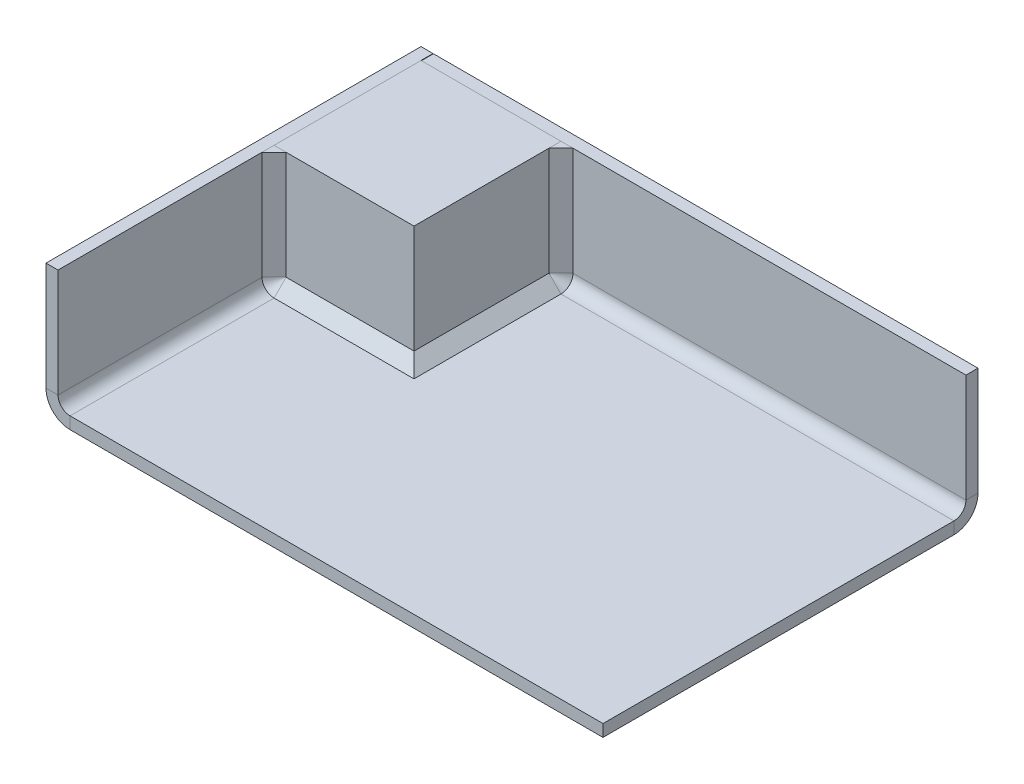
ISO-10303-21;
HEADER;
FILE_DESCRIPTION(('STEP AP214'),'2;1');
FILE_NAME('part.step','',(''),(''),'','','');
FILE_SCHEMA(('AUTOMOTIVE_DESIGN { 1 0 10303 214 1 1 1 1 }'));
ENDSEC;
DATA;
#1=APPLICATION_CONTEXT('core data for automotive mechanical design processes');
#2=APPLICATION_PROTOCOL_DEFINITION('international standard','automotive_design',2000,#1);
#3=PRODUCT_CONTEXT('',#1,'mechanical');
#4=PRODUCT('Part','Part','',(#3));
#5=PRODUCT_RELATED_PRODUCT_CATEGORY('part','',(#4));
#6=PRODUCT_DEFINITION_FORMATION('','',#4);
#7=PRODUCT_DEFINITION_CONTEXT('part definition',#1,'design');
#8=PRODUCT_DEFINITION('design','',#6,#7);
#9=PRODUCT_DEFINITION_SHAPE('','',#8);
#10=(LENGTH_UNIT() NAMED_UNIT(*) SI_UNIT(.MILLI.,.METRE.));
#11=(NAMED_UNIT(*) PLANE_ANGLE_UNIT() SI_UNIT($,.RADIAN.));
#12=(NAMED_UNIT(*) SI_UNIT($,.STERADIAN.) SOLID_ANGLE_UNIT());
#13=UNCERTAINTY_MEASURE_WITH_UNIT(LENGTH_MEASURE(1.E-05),#10,'distance_accuracy_value','');
#14=(GEOMETRIC_REPRESENTATION_CONTEXT(3) GLOBAL_UNCERTAINTY_ASSIGNED_CONTEXT((#13)) GLOBAL_UNIT_ASSIGNED_CONTEXT((#10,
#11,#12)) REPRESENTATION_CONTEXT('',''));
#15=CARTESIAN_POINT('',(0.,0.,0.));
#16=DIRECTION('',(0.,0.,1.));
#17=DIRECTION('',(1.,0.,0.));
#18=AXIS2_PLACEMENT_3D('',#15,#16,#17);
#19=CARTESIAN_POINT('',(-57.9818418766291,33.,-33.741615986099));
#20=DIRECTION('',(0.,-1.,0.));
#21=DIRECTION('',(1.,0.,0.));
#22=AXIS2_PLACEMENT_3D('',#19,#20,#21);
#23=PLANE('',#22);
#24=DIRECTION('',(-1.,0.,0.));
#25=VECTOR('',#24,1.);
#26=CARTESIAN_POINT('',(-20.0735004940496,33.0000000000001,2.91595713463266));
#27=LINE('',#26,#25);
#28=CARTESIAN_POINT('',(-51.9818418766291,33.,2.91595713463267));
#29=VERTEX_POINT('',#28);
#30=CARTESIAN_POINT('',(-54.9818418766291,33.0000000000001,2.91595713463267));
#31=VERTEX_POINT('',#30);
#32=EDGE_CURVE('E80',#29,#31,#27,.T.);
#33=ORIENTED_EDGE('',*,*,#32,.T.);
#34=DIRECTION('',(0.,0.,-1.));
#35=VECTOR('',#34,1.);
#36=CARTESIAN_POINT('',(-54.9818418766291,33.,-33.741615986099));
#37=LINE('',#36,#35);
#38=CARTESIAN_POINT('',(-54.9818418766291,33.,5.91595713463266));
#39=VERTEX_POINT('',#38);
#40=EDGE_CURVE('E177',#39,#31,#37,.T.);
#41=ORIENTED_EDGE('',*,*,#40,.F.);
#42=DIRECTION('',(0.707106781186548,0.,-0.707106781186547));
#43=VECTOR('',#42,1.);
#44=CARTESIAN_POINT('',(-36.6530553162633,33.0000000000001,-12.4128294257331));
#45=LINE('',#44,#43);
#46=EDGE_CURVE('E72',#39,#29,#45,.T.);
#47=ORIENTED_EDGE('',*,*,#46,.T.);
#48=EDGE_LOOP('',(#33,#41,#47));
#49=FACE_BOUND('',#48,.T.);
#50=ADVANCED_FACE('F63',(#49),#23,.F.);
#51=DIRECTION('',(0.707106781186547,0.,-0.707106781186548));
#52=VECTOR('',#51,1.);
#53=CARTESIAN_POINT('',(-37.5276711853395,33.0000000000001,-13.2874452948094));
#54=LINE('',#53,#52);
#55=CARTESIAN_POINT('',(-20.0735004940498,33.0000000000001,-30.7416159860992));
#56=VERTEX_POINT('',#55);
#57=CARTESIAN_POINT('',(-17.0735004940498,33.,-33.7416159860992));
#58=VERTEX_POINT('',#57);
#59=EDGE_CURVE('E13',#56,#58,#54,.T.);
#60=ORIENTED_EDGE('',*,*,#59,.T.);
#61=DIRECTION('',(1.,0.,0.));
#62=VECTOR('',#61,1.);
#63=CARTESIAN_POINT('',(80.9556038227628,33.,-33.7416159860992));
#64=LINE('',#63,#62);
#65=CARTESIAN_POINT('',(-20.0735004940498,33.0000000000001,-33.7416159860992));
#66=VERTEX_POINT('',#65);
#67=EDGE_CURVE('E88',#66,#58,#64,.T.);
#68=ORIENTED_EDGE('',*,*,#67,.F.);
#69=DIRECTION('',(0.,0.,1.));
#70=VECTOR('',#69,1.);
#71=CARTESIAN_POINT('',(-20.0735004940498,33.0000000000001,2.91595713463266));
#72=LINE('',#71,#70);
#73=EDGE_CURVE('E167',#66,#56,#72,.T.);
#74=ORIENTED_EDGE('',*,*,#73,.T.);
#75=EDGE_LOOP('',(#60,#68,#74));
#76=FACE_BOUND('',#75,.T.);
#77=ADVANCED_FACE('F239',(#76),#23,.F.);
#78=CARTESIAN_POINT('',(-17.0735004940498,33.,-33.7416159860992));
#79=DIRECTION('',(-0.707106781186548,0.,-0.707106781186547));
#80=DIRECTION('',(-0.707106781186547,0.,0.707106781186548));
#81=AXIS2_PLACEMENT_3D('',#78,#79,#80);
#82=PLANE('',#81);
#83=DIRECTION('',(-0.707106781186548,0.,0.707106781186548));
#84=VECTOR('',#83,1.);
#85=CARTESIAN_POINT('',(-17.0735004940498,5.99999999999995,-33.7416159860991));
#86=LINE('',#85,#84);
#87=CARTESIAN_POINT('',(-17.0735004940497,5.99999999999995,-33.7416159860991));
#88=VERTEX_POINT('',#87);
#89=CARTESIAN_POINT('',(-20.0735004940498,6.00000000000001,-30.741615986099));
#90=VERTEX_POINT('',#89);
#91=EDGE_CURVE('E67',#88,#90,#86,.T.);
#92=ORIENTED_EDGE('',*,*,#91,.F.);
#93=DIRECTION('',(0.,-1.,0.));
#94=VECTOR('',#93,1.);
#95=CARTESIAN_POINT('',(-17.0735004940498,33.,-33.7416159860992));
#96=LINE('',#95,#94);
#97=EDGE_CURVE('E201',#58,#88,#96,.T.);
#98=ORIENTED_EDGE('',*,*,#97,.F.);
#99=ORIENTED_EDGE('',*,*,#59,.F.);
#100=DIRECTION('',(0.,1.,0.));
#101=VECTOR('',#100,1.);
#102=CARTESIAN_POINT('',(-20.0735004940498,83.6198574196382,-30.7416159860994));
#103=LINE('',#102,#101);
#104=EDGE_CURVE('E205',#90,#56,#103,.T.);
#105=ORIENTED_EDGE('',*,*,#104,.F.);
#106=EDGE_LOOP('',(#92,#98,#99,#105));
#107=FACE_BOUND('',#106,.T.);
#108=ADVANCED_FACE('F65',(#107),#82,.F.);
#109=CARTESIAN_POINT('',(-17.0735004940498,6.,-30.741615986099));
#110=DIRECTION('',(1.,0.,0.));
#111=DIRECTION('',(0.,0.,-1.));
#112=AXIS2_PLACEMENT_3D('',#109,#110,#111);
#113=CONICAL_SURFACE('',#112,2.99999999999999,0.785398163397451);
#114=CARTESIAN_POINT('',(-17.0735004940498,6.,-30.741615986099));
#115=DIRECTION('',(-1.,0.,0.));
#116=DIRECTION('',(0.,0.,1.));
#117=AXIS2_PLACEMENT_3D('',#114,#115,#116);
#118=CIRCLE('',#117,3.00000002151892);
#119=CARTESIAN_POINT('',(-17.0735004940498,3.,-30.741615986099));
#120=VERTEX_POINT('',#119);
#121=EDGE_CURVE('E209',#88,#120,#118,.T.);
#122=ORIENTED_EDGE('',*,*,#121,.F.);
#123=ORIENTED_EDGE('',*,*,#91,.T.);
#124=DIRECTION('',(-0.707106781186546,0.707106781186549,0.));
#125=VECTOR('',#124,1.);
#126=CARTESIAN_POINT('',(-17.0735004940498,2.99999997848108,-30.741615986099));
#127=LINE('',#126,#125);
#128=EDGE_CURVE('E223',#120,#90,#127,.T.);
#129=ORIENTED_EDGE('',*,*,#128,.F.);
#130=EDGE_LOOP('',(#122,#123,#129));
#131=FACE_BOUND('',#130,.T.);
#132=ADVANCED_FACE('F232',(#131),#113,.F.);
#133=CARTESIAN_POINT('',(-20.0735004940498,6.00000000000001,2.91595713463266));
#134=DIRECTION('',(-0.707106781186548,-0.707106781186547,0.));
#135=DIRECTION('',(0.707106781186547,-0.707106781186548,0.));
#136=AXIS2_PLACEMENT_3D('',#133,#134,#135);
#137=PLANE('',#136);
#138=ORIENTED_EDGE('',*,*,#128,.T.);
#139=DIRECTION('',(0.,0.,-1.));
#140=VECTOR('',#139,1.);
#141=CARTESIAN_POINT('',(-20.0735004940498,6.00000000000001,2.91595713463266));
#142=LINE('',#141,#140);
#143=CARTESIAN_POINT('',(-20.0735004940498,6.00000000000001,2.91595713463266));
#144=VERTEX_POINT('',#143);
#145=EDGE_CURVE('E203',#144,#90,#142,.T.);
#146=ORIENTED_EDGE('',*,*,#145,.F.);
#147=DIRECTION('',(0.577350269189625,-0.577350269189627,0.577350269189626));
#148=VECTOR('',#147,1.);
#149=CARTESIAN_POINT('',(-20.0735004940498,6.00000000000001,2.91595713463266));
#150=LINE('',#149,#148);
#151=CARTESIAN_POINT('',(-17.0735004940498,3.00000000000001,5.91595713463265));
#152=VERTEX_POINT('',#151);
#153=EDGE_CURVE('E221',#152,#144,#150,.F.);
#154=ORIENTED_EDGE('',*,*,#153,.F.);
#155=DIRECTION('',(0.,0.,1.));
#156=VECTOR('',#155,1.);
#157=CARTESIAN_POINT('',(-17.0735004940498,3.00000000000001,56.8024326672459));
#158=LINE('',#157,#156);
#159=EDGE_CURVE('E211',#120,#152,#158,.T.);
#160=ORIENTED_EDGE('',*,*,#159,.F.);
#161=EDGE_LOOP('',(#138,#146,#154,#160));
#162=FACE_BOUND('',#161,.T.);
#163=ADVANCED_FACE('F262',(#162),#137,.F.);
#164=CARTESIAN_POINT('',(-20.0735004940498,6.00000000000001,2.91595713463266));
#165=DIRECTION('',(0.,-0.707106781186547,-0.707106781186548));
#166=DIRECTION('',(0.,0.707106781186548,-0.707106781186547));
#167=AXIS2_PLACEMENT_3D('',#164,#165,#166);
#168=PLANE('',#167);
#169=DIRECTION('',(0.,0.707106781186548,-0.707106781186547));
#170=VECTOR('',#169,1.);
#171=CARTESIAN_POINT('',(-51.981841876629,3.00000000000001,5.91595713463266));
#172=LINE('',#171,#170);
#173=CARTESIAN_POINT('',(-51.981841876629,3.00000000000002,5.91595713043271));
#174=VERTEX_POINT('',#173);
#175=CARTESIAN_POINT('',(-51.981841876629,5.99999999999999,2.91595713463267));
#176=VERTEX_POINT('',#175);
#177=EDGE_CURVE('E218',#174,#176,#172,.T.);
#178=ORIENTED_EDGE('',*,*,#177,.F.);
#179=DIRECTION('',(-1.,0.,0.));
#180=VECTOR('',#179,1.);
#181=CARTESIAN_POINT('',(-54.981841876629,3.00000000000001,5.91595713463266));
#182=LINE('',#181,#180);
#183=EDGE_CURVE('E213',#152,#174,#182,.T.);
#184=ORIENTED_EDGE('',*,*,#183,.F.);
#185=ORIENTED_EDGE('',*,*,#153,.T.);
#186=DIRECTION('',(1.,0.,0.));
#187=VECTOR('',#186,1.);
#188=CARTESIAN_POINT('',(-20.0735004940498,6.00000000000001,2.91595713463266));
#189=LINE('',#188,#187);
#190=EDGE_CURVE('E145',#176,#144,#189,.T.);
#191=ORIENTED_EDGE('',*,*,#190,.F.);
#192=EDGE_LOOP('',(#178,#184,#185,#191));
#193=FACE_BOUND('',#192,.T.);
#194=ADVANCED_FACE('F258',(#193),#168,.F.);
#195=CARTESIAN_POINT('',(-51.981841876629,6.,5.91595713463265));
#196=DIRECTION('',(0.,0.,1.));
#197=DIRECTION('',(1.,0.,0.));
#198=AXIS2_PLACEMENT_3D('',#195,#196,#197);
#199=CONICAL_SURFACE('',#198,2.99999999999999,0.785398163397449);
#200=CARTESIAN_POINT('',(-51.981841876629,6.,5.91595713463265));
#201=DIRECTION('',(0.,0.,-1.));
#202=DIRECTION('',(-1.,0.,0.));
#203=AXIS2_PLACEMENT_3D('',#200,#201,#202);
#204=CIRCLE('',#203,2.99999999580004);
#205=CARTESIAN_POINT('',(-54.981841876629,5.99999999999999,5.91595713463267));
#206=VERTEX_POINT('',#205);
#207=EDGE_CURVE('E207',#174,#206,#204,.T.);
#208=ORIENTED_EDGE('',*,*,#207,.F.);
#209=ORIENTED_EDGE('',*,*,#177,.T.);
#210=DIRECTION('',(0.70710678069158,0.,-0.707106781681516));
#211=VECTOR('',#210,1.);
#212=CARTESIAN_POINT('',(-54.9818418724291,5.99999999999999,5.91595713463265));
#213=LINE('',#212,#211);
#214=EDGE_CURVE('E191',#206,#176,#213,.T.);
#215=ORIENTED_EDGE('',*,*,#214,.F.);
#216=EDGE_LOOP('',(#208,#209,#215));
#217=FACE_BOUND('',#216,.T.);
#218=ADVANCED_FACE('F254',(#217),#199,.F.);
#219=CARTESIAN_POINT('',(-51.9818418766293,83.6198574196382,2.91595713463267));
#220=DIRECTION('',(-0.707106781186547,0.,-0.707106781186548));
#221=DIRECTION('',(-0.707106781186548,0.,0.707106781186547));
#222=AXIS2_PLACEMENT_3D('',#219,#220,#221);
#223=PLANE('',#222);
#224=ORIENTED_EDGE('',*,*,#46,.F.);
#225=DIRECTION('',(0.,1.,0.));
#226=VECTOR('',#225,1.);
#227=CARTESIAN_POINT('',(-54.9818418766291,33.,5.91595713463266));
#228=LINE('',#227,#226);
#229=EDGE_CURVE('E199',#206,#39,#228,.T.);
#230=ORIENTED_EDGE('',*,*,#229,.F.);
#231=ORIENTED_EDGE('',*,*,#214,.T.);
#232=DIRECTION('',(0.,-1.,0.));
#233=VECTOR('',#232,1.);
#234=CARTESIAN_POINT('',(-51.9818418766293,83.6198574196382,2.91595713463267));
#235=LINE('',#234,#233);
#236=EDGE_CURVE('E197',#29,#176,#235,.T.);
#237=ORIENTED_EDGE('',*,*,#236,.F.);
#238=EDGE_LOOP('',(#224,#230,#231,#237));
#239=FACE_BOUND('',#238,.T.);
#240=ADVANCED_FACE('F250',(#239),#223,.F.);
#241=CARTESIAN_POINT('',(80.9556038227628,33.,-33.7416159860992));
#242=DIRECTION('',(0.,0.,1.));
#243=DIRECTION('',(0.,-1.,0.));
#244=AXIS2_PLACEMENT_3D('',#241,#242,#243);
#245=PLANE('',#244);
#246=DIRECTION('',(-1.,0.,0.));
#247=VECTOR('',#246,1.);
#248=CARTESIAN_POINT('',(80.9556038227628,5.99999999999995,-33.7416159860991));
#249=LINE('',#248,#247);
#250=CARTESIAN_POINT('',(-20.0735004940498,5.99999999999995,-33.7416159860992));
#251=VERTEX_POINT('',#250);
#252=EDGE_CURVE('E174',#88,#251,#249,.T.);
#253=ORIENTED_EDGE('',*,*,#252,.T.);
#254=DIRECTION('',(0.,-1.,0.));
#255=VECTOR('',#254,1.);
#256=CARTESIAN_POINT('',(-20.0735004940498,83.6198574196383,-33.7416159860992));
#257=LINE('',#256,#255);
#258=EDGE_CURVE('E170',#66,#251,#257,.T.);
#259=ORIENTED_EDGE('',*,*,#258,.F.);
#260=ORIENTED_EDGE('',*,*,#67,.T.);
#261=ORIENTED_EDGE('',*,*,#97,.T.);
#262=EDGE_LOOP('',(#253,#259,#260,#261));
#263=FACE_BOUND('',#262,.T.);
#264=ADVANCED_FACE('F253',(#263),#245,.F.);
#265=CARTESIAN_POINT('',(150.456295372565,6.,-30.741615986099));
#266=DIRECTION('',(-1.,0.,0.));
#267=DIRECTION('',(0.,0.,1.));
#268=AXIS2_PLACEMENT_3D('',#265,#266,#267);
#269=CYLINDRICAL_SURFACE('',#268,3.00000002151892);
#270=DIRECTION('',(1.,0.,0.));
#271=VECTOR('',#270,1.);
#272=CARTESIAN_POINT('',(-51.981841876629,3.,-30.741615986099));
#273=LINE('',#272,#271);
#274=CARTESIAN_POINT('',(-20.0735004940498,3.00000000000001,-30.741615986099));
#275=VERTEX_POINT('',#274);
#276=EDGE_CURVE('E187',#275,#120,#273,.T.);
#277=ORIENTED_EDGE('',*,*,#276,.F.);
#278=CARTESIAN_POINT('',(-20.0735004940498,6.,-30.741615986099));
#279=DIRECTION('',(-1.,0.,0.));
#280=DIRECTION('',(0.,0.,1.));
#281=AXIS2_PLACEMENT_3D('',#278,#279,#280);
#282=CIRCLE('',#281,3.00000002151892);
#283=EDGE_CURVE('E163',#251,#275,#282,.T.);
#284=ORIENTED_EDGE('',*,*,#283,.F.);
#285=ORIENTED_EDGE('',*,*,#252,.F.);
#286=ORIENTED_EDGE('',*,*,#121,.T.);
#287=EDGE_LOOP('',(#277,#284,#285,#286));
#288=FACE_BOUND('',#287,.T.);
#289=ADVANCED_FACE('F292',(#288),#269,.T.);
#290=CARTESIAN_POINT('',(-20.0735004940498,83.6198574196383,2.91595713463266));
#291=DIRECTION('',(-1.,0.,0.));
#292=DIRECTION('',(0.,0.,1.));
#293=AXIS2_PLACEMENT_3D('',#290,#291,#292);
#294=PLANE('',#293);
#295=ORIENTED_EDGE('',*,*,#104,.T.);
#296=ORIENTED_EDGE('',*,*,#73,.F.);
#297=ORIENTED_EDGE('',*,*,#258,.T.);
#298=ORIENTED_EDGE('',*,*,#283,.T.);
#299=DIRECTION('',(0.,0.,-1.));
#300=VECTOR('',#299,1.);
#301=CARTESIAN_POINT('',(-20.0735004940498,3.00000000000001,2.91595713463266));
#302=LINE('',#301,#300);
#303=CARTESIAN_POINT('',(-20.0735004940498,3.00000000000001,2.91595713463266));
#304=VERTEX_POINT('',#303);
#305=EDGE_CURVE('E154',#304,#275,#302,.T.);
#306=ORIENTED_EDGE('',*,*,#305,.F.);
#307=DIRECTION('',(0.,-1.,0.));
#308=VECTOR('',#307,1.);
#309=CARTESIAN_POINT('',(-20.0735004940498,83.6198574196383,2.91595713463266));
#310=LINE('',#309,#308);
#311=EDGE_CURVE('E139',#144,#304,#310,.T.);
#312=ORIENTED_EDGE('',*,*,#311,.F.);
#313=ORIENTED_EDGE('',*,*,#145,.T.);
#314=EDGE_LOOP('',(#295,#296,#297,#298,#306,#312,#313));
#315=FACE_BOUND('',#314,.T.);
#316=ADVANCED_FACE('F160',(#315),#294,.T.);
#317=CARTESIAN_POINT('',(-54.981841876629,3.00000000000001,56.8024326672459));
#318=DIRECTION('',(0.,1.,0.));
#319=DIRECTION('',(0.,0.,1.));
#320=AXIS2_PLACEMENT_3D('',#317,#318,#319);
#321=PLANE('',#320);
#322=ORIENTED_EDGE('',*,*,#183,.T.);
#323=DIRECTION('',(0.,0.,-1.));
#324=VECTOR('',#323,1.);
#325=CARTESIAN_POINT('',(-51.981841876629,3.00000000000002,56.8024326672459));
#326=LINE('',#325,#324);
#327=CARTESIAN_POINT('',(-51.981841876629,3.00000000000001,2.91595713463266));
#328=VERTEX_POINT('',#327);
#329=EDGE_CURVE('E157',#174,#328,#326,.T.);
#330=ORIENTED_EDGE('',*,*,#329,.T.);
#331=DIRECTION('',(1.,0.,0.));
#332=VECTOR('',#331,1.);
#333=CARTESIAN_POINT('',(-20.0735004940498,3.00000000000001,2.91595713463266));
#334=LINE('',#333,#332);
#335=EDGE_CURVE('E143',#328,#304,#334,.T.);
#336=ORIENTED_EDGE('',*,*,#335,.T.);
#337=ORIENTED_EDGE('',*,*,#305,.T.);
#338=ORIENTED_EDGE('',*,*,#276,.T.);
#339=ORIENTED_EDGE('',*,*,#159,.T.);
#340=EDGE_LOOP('',(#322,#330,#336,#337,#338,#339));
#341=FACE_BOUND('',#340,.T.);
#342=ADVANCED_FACE('F152',(#341),#321,.F.);
#343=CARTESIAN_POINT('',(-54.9818418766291,33.,-33.741615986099));
#344=DIRECTION('',(1.,0.,0.));
#345=DIRECTION('',(0.,1.,0.));
#346=AXIS2_PLACEMENT_3D('',#343,#344,#345);
#347=PLANE('',#346);
#348=ORIENTED_EDGE('',*,*,#40,.T.);
#349=DIRECTION('',(0.,-1.,0.));
#350=VECTOR('',#349,1.);
#351=CARTESIAN_POINT('',(-54.9818418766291,83.6198574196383,2.91595713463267));
#352=LINE('',#351,#350);
#353=CARTESIAN_POINT('',(-54.9818418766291,6.00000000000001,2.91595713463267));
#354=VERTEX_POINT('',#353);
#355=EDGE_CURVE('E149',#31,#354,#352,.T.);
#356=ORIENTED_EDGE('',*,*,#355,.T.);
#357=DIRECTION('',(0.,0.,1.));
#358=VECTOR('',#357,1.);
#359=CARTESIAN_POINT('',(-54.981841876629,5.99999999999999,-33.741615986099));
#360=LINE('',#359,#358);
#361=EDGE_CURVE('E176',#354,#206,#360,.T.);
#362=ORIENTED_EDGE('',*,*,#361,.T.);
#363=ORIENTED_EDGE('',*,*,#229,.T.);
#364=EDGE_LOOP('',(#348,#356,#362,#363));
#365=FACE_BOUND('',#364,.T.);
#366=ADVANCED_FACE('F312',(#365),#347,.F.);
#367=CARTESIAN_POINT('',(-51.981841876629,6.,103.765988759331));
#368=DIRECTION('',(0.,0.,-1.));
#369=DIRECTION('',(-1.,0.,0.));
#370=AXIS2_PLACEMENT_3D('',#367,#368,#369);
#371=CYLINDRICAL_SURFACE('',#370,2.99999999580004);
#372=ORIENTED_EDGE('',*,*,#361,.F.);
#373=CARTESIAN_POINT('',(-51.981841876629,6.,2.91595713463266));
#374=DIRECTION('',(0.,0.,-1.));
#375=DIRECTION('',(-1.,0.,0.));
#376=AXIS2_PLACEMENT_3D('',#373,#374,#375);
#377=CIRCLE('',#376,2.99999999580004);
#378=EDGE_CURVE('E189',#328,#354,#377,.T.);
#379=ORIENTED_EDGE('',*,*,#378,.F.);
#380=ORIENTED_EDGE('',*,*,#329,.F.);
#381=ORIENTED_EDGE('',*,*,#207,.T.);
#382=EDGE_LOOP('',(#372,#379,#380,#381));
#383=FACE_BOUND('',#382,.T.);
#384=ADVANCED_FACE('F318',(#383),#371,.T.);
#385=CARTESIAN_POINT('',(-20.0735004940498,83.6198574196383,2.91595713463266));
#386=DIRECTION('',(0.,0.,-1.));
#387=DIRECTION('',(-1.,0.,0.));
#388=AXIS2_PLACEMENT_3D('',#385,#386,#387);
#389=PLANE('',#388);
#390=ORIENTED_EDGE('',*,*,#190,.T.);
#391=ORIENTED_EDGE('',*,*,#311,.T.);
#392=ORIENTED_EDGE('',*,*,#335,.F.);
#393=ORIENTED_EDGE('',*,*,#378,.T.);
#394=ORIENTED_EDGE('',*,*,#355,.F.);
#395=ORIENTED_EDGE('',*,*,#32,.F.);
#396=ORIENTED_EDGE('',*,*,#236,.T.);
#397=EDGE_LOOP('',(#390,#391,#392,#393,#394,#395,#396));
#398=FACE_BOUND('',#397,.T.);
#399=ADVANCED_FACE('F141',(#398),#389,.T.);
#400=CLOSED_SHELL('',(#50,#77,#108,#132,#163,#194,#218,#240,#264,#289,#316,#342,#366,#384,#399));
#401=MANIFOLD_SOLID_BREP('B2',#400);
#402=CARTESIAN_POINT('',(-20.0735004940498,3.00000000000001,-33.7416159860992));
#403=DIRECTION('',(0.,1.,0.));
#404=DIRECTION('',(0.,0.,1.));
#405=AXIS2_PLACEMENT_3D('',#402,#403,#404);
#406=PLANE('',#405);
#407=DIRECTION('',(0.,0.,-1.));
#408=VECTOR('',#407,1.);
#409=CARTESIAN_POINT('',(-20.0735004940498,3.00000000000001,2.91595713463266));
#410=LINE('',#409,#408);
#411=CARTESIAN_POINT('',(-20.0735004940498,3.00000000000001,2.91595713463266));
#412=VERTEX_POINT('',#411);
#413=CARTESIAN_POINT('',(-20.0735004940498,3.00000000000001,-33.7416159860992));
#414=VERTEX_POINT('',#413);
#415=EDGE_CURVE('E457',#412,#414,#410,.T.);
#416=ORIENTED_EDGE('',*,*,#415,.F.);
#417=DIRECTION('',(1.,0.,0.));
#418=VECTOR('',#417,1.);
#419=CARTESIAN_POINT('',(-20.0735004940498,3.00000000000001,2.91595713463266));
#420=LINE('',#419,#418);
#421=CARTESIAN_POINT('',(-54.9818418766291,3.00000000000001,2.91595713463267));
#422=VERTEX_POINT('',#421);
#423=EDGE_CURVE('E468',#422,#412,#420,.T.);
#424=ORIENTED_EDGE('',*,*,#423,.F.);
#425=DIRECTION('',(0.,0.,1.));
#426=VECTOR('',#425,1.);
#427=CARTESIAN_POINT('',(-54.9818418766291,3.00000000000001,2.91595713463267));
#428=LINE('',#427,#426);
#429=CARTESIAN_POINT('',(-54.9818418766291,3.00000000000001,-33.7416159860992));
#430=VERTEX_POINT('',#429);
#431=EDGE_CURVE('E459',#430,#422,#428,.T.);
#432=ORIENTED_EDGE('',*,*,#431,.F.);
#433=DIRECTION('',(-1.,0.,0.));
#434=VECTOR('',#433,1.);
#435=CARTESIAN_POINT('',(-20.0735004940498,3.00000000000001,-33.7416159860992));
#436=LINE('',#435,#434);
#437=EDGE_CURVE('E449',#414,#430,#436,.T.);
#438=ORIENTED_EDGE('',*,*,#437,.F.);
#439=EDGE_LOOP('',(#416,#424,#432,#438));
#440=FACE_BOUND('',#439,.T.);
#441=ADVANCED_FACE('F408',(#440),#406,.F.);
#442=CARTESIAN_POINT('',(-20.0735004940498,83.6198574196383,2.91595713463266));
#443=DIRECTION('',(0.,0.,-1.));
#444=DIRECTION('',(-1.,0.,0.));
#445=AXIS2_PLACEMENT_3D('',#442,#443,#444);
#446=PLANE('',#445);
#447=DIRECTION('',(0.,-1.,0.));
#448=VECTOR('',#447,1.);
#449=CARTESIAN_POINT('',(-20.0735004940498,83.6198574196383,2.91595713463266));
#450=LINE('',#449,#448);
#451=CARTESIAN_POINT('',(-20.0735004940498,33.0000000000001,2.91595713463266));
#452=VERTEX_POINT('',#451);
#453=EDGE_CURVE('E462',#452,#412,#450,.T.);
#454=ORIENTED_EDGE('',*,*,#453,.F.);
#455=DIRECTION('',(-1.,0.,0.));
#456=VECTOR('',#455,1.);
#457=CARTESIAN_POINT('',(-20.0735004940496,33.0000000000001,2.91595713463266));
#458=LINE('',#457,#456);
#459=CARTESIAN_POINT('',(-54.9818418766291,33.0000000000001,2.91595713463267));
#460=VERTEX_POINT('',#459);
#461=EDGE_CURVE('E412',#452,#460,#458,.T.);
#462=ORIENTED_EDGE('',*,*,#461,.T.);
#463=DIRECTION('',(0.,-1.,0.));
#464=VECTOR('',#463,1.);
#465=CARTESIAN_POINT('',(-54.9818418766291,83.6198574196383,2.91595713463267));
#466=LINE('',#465,#464);
#467=EDGE_CURVE('E471',#460,#422,#466,.T.);
#468=ORIENTED_EDGE('',*,*,#467,.T.);
#469=ORIENTED_EDGE('',*,*,#423,.T.);
#470=EDGE_LOOP('',(#454,#462,#468,#469));
#471=FACE_BOUND('',#470,.T.);
#472=ADVANCED_FACE('F481',(#471),#446,.F.);
#473=CARTESIAN_POINT('',(-54.9818418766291,83.6198574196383,2.91595713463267));
#474=DIRECTION('',(1.,0.,0.));
#475=DIRECTION('',(0.,0.,-1.));
#476=AXIS2_PLACEMENT_3D('',#473,#474,#475);
#477=PLANE('',#476);
#478=ORIENTED_EDGE('',*,*,#467,.F.);
#479=DIRECTION('',(0.,0.,-1.));
#480=VECTOR('',#479,1.);
#481=CARTESIAN_POINT('',(-54.9818418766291,33.,2.91595713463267));
#482=LINE('',#481,#480);
#483=CARTESIAN_POINT('',(-54.9818418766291,33.,-33.7416159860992));
#484=VERTEX_POINT('',#483);
#485=EDGE_CURVE('E477',#460,#484,#482,.T.);
#486=ORIENTED_EDGE('',*,*,#485,.T.);
#487=DIRECTION('',(0.,-1.,0.));
#488=VECTOR('',#487,1.);
#489=CARTESIAN_POINT('',(-54.9818418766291,83.6198574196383,-33.7416159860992));
#490=LINE('',#489,#488);
#491=EDGE_CURVE('E453',#484,#430,#490,.T.);
#492=ORIENTED_EDGE('',*,*,#491,.T.);
#493=ORIENTED_EDGE('',*,*,#431,.T.);
#494=EDGE_LOOP('',(#478,#486,#492,#493));
#495=FACE_BOUND('',#494,.T.);
#496=ADVANCED_FACE('F476',(#495),#477,.F.);
#497=CARTESIAN_POINT('',(-20.0735004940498,83.6198574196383,-33.7416159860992));
#498=DIRECTION('',(0.,0.,1.));
#499=DIRECTION('',(1.,0.,0.));
#500=AXIS2_PLACEMENT_3D('',#497,#498,#499);
#501=PLANE('',#500);
#502=ORIENTED_EDGE('',*,*,#491,.F.);
#503=DIRECTION('',(1.,0.,0.));
#504=VECTOR('',#503,1.);
#505=CARTESIAN_POINT('',(-20.0735004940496,33.0000000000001,-33.7416159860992));
#506=LINE('',#505,#504);
#507=CARTESIAN_POINT('',(-20.0735004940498,33.0000000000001,-33.7416159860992));
#508=VERTEX_POINT('',#507);
#509=EDGE_CURVE('E417',#484,#508,#506,.T.);
#510=ORIENTED_EDGE('',*,*,#509,.T.);
#511=DIRECTION('',(0.,-1.,0.));
#512=VECTOR('',#511,1.);
#513=CARTESIAN_POINT('',(-20.0735004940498,83.6198574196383,-33.7416159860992));
#514=LINE('',#513,#512);
#515=EDGE_CURVE('E446',#508,#414,#514,.T.);
#516=ORIENTED_EDGE('',*,*,#515,.T.);
#517=ORIENTED_EDGE('',*,*,#437,.T.);
#518=EDGE_LOOP('',(#502,#510,#516,#517));
#519=FACE_BOUND('',#518,.T.);
#520=ADVANCED_FACE('F448',(#519),#501,.F.);
#521=CARTESIAN_POINT('',(-20.0735004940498,83.6198574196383,2.91595713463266));
#522=DIRECTION('',(-1.,0.,0.));
#523=DIRECTION('',(0.,0.,1.));
#524=AXIS2_PLACEMENT_3D('',#521,#522,#523);
#525=PLANE('',#524);
#526=ORIENTED_EDGE('',*,*,#515,.F.);
#527=DIRECTION('',(0.,0.,1.));
#528=VECTOR('',#527,1.);
#529=CARTESIAN_POINT('',(-20.0735004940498,33.0000000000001,2.91595713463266));
#530=LINE('',#529,#528);
#531=EDGE_CURVE('E61',#508,#452,#530,.T.);
#532=ORIENTED_EDGE('',*,*,#531,.T.);
#533=ORIENTED_EDGE('',*,*,#453,.T.);
#534=ORIENTED_EDGE('',*,*,#415,.T.);
#535=EDGE_LOOP('',(#526,#532,#533,#534));
#536=FACE_BOUND('',#535,.T.);
#537=ADVANCED_FACE('F410',(#536),#525,.F.);
#538=CARTESIAN_POINT('',(-57.9818418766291,33.,-33.741615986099));
#539=DIRECTION('',(0.,-1.,0.));
#540=DIRECTION('',(1.,0.,0.));
#541=AXIS2_PLACEMENT_3D('',#538,#539,#540);
#542=PLANE('',#541);
#543=ORIENTED_EDGE('',*,*,#509,.F.);
#544=ORIENTED_EDGE('',*,*,#485,.F.);
#545=ORIENTED_EDGE('',*,*,#461,.F.);
#546=ORIENTED_EDGE('',*,*,#531,.F.);
#547=EDGE_LOOP('',(#543,#544,#545,#546));
#548=FACE_BOUND('',#547,.T.);
#549=ADVANCED_FACE('F482',(#548),#542,.F.);
#550=CLOSED_SHELL('',(#441,#472,#496,#520,#537,#549));
#551=MANIFOLD_SOLID_BREP('B7',#550);
#552=CARTESIAN_POINT('',(-54.981841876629,3.00000000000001,56.8024326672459));
#553=DIRECTION('',(0.,1.,0.));
#554=DIRECTION('',(0.,0.,1.));
#555=AXIS2_PLACEMENT_3D('',#552,#553,#554);
#556=PLANE('',#555);
#557=DIRECTION('',(0.,0.,-1.));
#558=VECTOR('',#557,1.);
#559=CARTESIAN_POINT('',(80.9556038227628,3.00000000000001,-33.741615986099));
#560=LINE('',#559,#558);
#561=CARTESIAN_POINT('',(80.9556038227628,3.00000000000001,56.8024326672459));
#562=VERTEX_POINT('',#561);
#563=CARTESIAN_POINT('',(80.9556038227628,2.99999999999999,-30.741615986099));
#564=VERTEX_POINT('',#563);
#565=EDGE_CURVE('E886',#562,#564,#560,.T.);
#566=ORIENTED_EDGE('',*,*,#565,.T.);
#567=DIRECTION('',(1.,0.,0.));
#568=VECTOR('',#567,1.);
#569=CARTESIAN_POINT('',(-51.981841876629,3.,-30.741615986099));
#570=LINE('',#569,#568);
#571=CARTESIAN_POINT('',(-51.981841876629,2.99999997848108,-30.7416159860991));
#572=VERTEX_POINT('',#571);
#573=EDGE_CURVE('E890',#572,#564,#570,.T.);
#574=ORIENTED_EDGE('',*,*,#573,.F.);
#575=DIRECTION('',(0.,0.,-1.));
#576=VECTOR('',#575,1.);
#577=CARTESIAN_POINT('',(-51.981841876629,3.00000000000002,56.8024326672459));
#578=LINE('',#577,#576);
#579=CARTESIAN_POINT('',(-51.981841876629,3.00000000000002,56.8024326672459));
#580=VERTEX_POINT('',#579);
#581=EDGE_CURVE('E940',#580,#572,#578,.T.);
#582=ORIENTED_EDGE('',*,*,#581,.F.);
#583=DIRECTION('',(1.,0.,0.));
#584=VECTOR('',#583,1.);
#585=CARTESIAN_POINT('',(-54.981841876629,3.00000000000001,56.8024326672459));
#586=LINE('',#585,#584);
#587=EDGE_CURVE('E956',#580,#562,#586,.T.);
#588=ORIENTED_EDGE('',*,*,#587,.T.);
#589=EDGE_LOOP('',(#566,#574,#582,#588));
#590=FACE_BOUND('',#589,.T.);
#591=ADVANCED_FACE('F531',(#590),#556,.T.);
#592=CARTESIAN_POINT('',(-54.981841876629,0.,56.8024326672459));
#593=DIRECTION('',(0.,1.,0.));
#594=DIRECTION('',(0.,0.,1.));
#595=AXIS2_PLACEMENT_3D('',#592,#593,#594);
#596=PLANE('',#595);
#597=DIRECTION('',(1.,0.,0.));
#598=VECTOR('',#597,1.);
#599=CARTESIAN_POINT('',(-51.9818418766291,0.,-30.741615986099));
#600=LINE('',#599,#598);
#601=CARTESIAN_POINT('',(-51.981841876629,0.,-30.741615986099));
#602=VERTEX_POINT('',#601);
#603=CARTESIAN_POINT('',(80.9556038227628,0.,-30.741615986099));
#604=VERTEX_POINT('',#603);
#605=EDGE_CURVE('E542',#602,#604,#600,.T.);
#606=ORIENTED_EDGE('',*,*,#605,.T.);
#607=DIRECTION('',(0.,0.,-1.));
#608=VECTOR('',#607,1.);
#609=CARTESIAN_POINT('',(80.9556038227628,0.,-33.741615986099));
#610=LINE('',#609,#608);
#611=CARTESIAN_POINT('',(80.9556038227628,0.,56.8024326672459));
#612=VERTEX_POINT('',#611);
#613=EDGE_CURVE('E557',#612,#604,#610,.T.);
#614=ORIENTED_EDGE('',*,*,#613,.F.);
#615=DIRECTION('',(1.,0.,0.));
#616=VECTOR('',#615,1.);
#617=CARTESIAN_POINT('',(-54.981841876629,0.,56.8024326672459));
#618=LINE('',#617,#616);
#619=CARTESIAN_POINT('',(-51.981841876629,0.,56.8024326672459));
#620=VERTEX_POINT('',#619);
#621=EDGE_CURVE('E816',#620,#612,#618,.T.);
#622=ORIENTED_EDGE('',*,*,#621,.F.);
#623=DIRECTION('',(0.,0.,-1.));
#624=VECTOR('',#623,1.);
#625=CARTESIAN_POINT('',(-51.981841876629,0.,56.8024326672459));
#626=LINE('',#625,#624);
#627=EDGE_CURVE('E549',#620,#602,#626,.T.);
#628=ORIENTED_EDGE('',*,*,#627,.T.);
#629=EDGE_LOOP('',(#606,#614,#622,#628));
#630=FACE_BOUND('',#629,.T.);
#631=ADVANCED_FACE('F872',(#630),#596,.F.);
#632=CARTESIAN_POINT('',(80.9556038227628,3.00000000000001,-33.741615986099));
#633=DIRECTION('',(-1.,0.,0.));
#634=DIRECTION('',(0.,0.,1.));
#635=AXIS2_PLACEMENT_3D('',#632,#633,#634);
#636=PLANE('',#635);
#637=DIRECTION('',(0.,-1.,0.));
#638=VECTOR('',#637,1.);
#639=CARTESIAN_POINT('',(80.9556038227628,2.99999999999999,-30.741615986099));
#640=LINE('',#639,#638);
#641=EDGE_CURVE('E884',#564,#604,#640,.T.);
#642=ORIENTED_EDGE('',*,*,#641,.F.);
#643=ORIENTED_EDGE('',*,*,#565,.F.);
#644=DIRECTION('',(0.,-1.,0.));
#645=VECTOR('',#644,1.);
#646=CARTESIAN_POINT('',(80.9556038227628,3.00000000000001,56.8024326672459));
#647=LINE('',#646,#645);
#648=EDGE_CURVE('E944',#562,#612,#647,.T.);
#649=ORIENTED_EDGE('',*,*,#648,.T.);
#650=ORIENTED_EDGE('',*,*,#613,.T.);
#651=EDGE_LOOP('',(#642,#643,#649,#650));
#652=FACE_BOUND('',#651,.T.);
#653=ADVANCED_FACE('F875',(#652),#636,.F.);
#654=CARTESIAN_POINT('',(-54.981841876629,3.00000000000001,56.8024326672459));
#655=DIRECTION('',(0.,0.,-1.));
#656=DIRECTION('',(-1.,0.,0.));
#657=AXIS2_PLACEMENT_3D('',#654,#655,#656);
#658=PLANE('',#657);
#659=DIRECTION('',(0.,-1.,0.));
#660=VECTOR('',#659,1.);
#661=CARTESIAN_POINT('',(-51.981841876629,3.00000000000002,56.8024326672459));
#662=LINE('',#661,#660);
#663=EDGE_CURVE('E894',#580,#620,#662,.T.);
#664=ORIENTED_EDGE('',*,*,#663,.T.);
#665=ORIENTED_EDGE('',*,*,#621,.T.);
#666=ORIENTED_EDGE('',*,*,#648,.F.);
#667=ORIENTED_EDGE('',*,*,#587,.F.);
#668=EDGE_LOOP('',(#664,#665,#666,#667));
#669=FACE_BOUND('',#668,.T.);
#670=ADVANCED_FACE('F533',(#669),#658,.F.);
#671=CARTESIAN_POINT('',(-57.9818418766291,33.,-33.741615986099));
#672=DIRECTION('',(0.,-1.,0.));
#673=DIRECTION('',(1.,0.,0.));
#674=AXIS2_PLACEMENT_3D('',#671,#672,#673);
#675=PLANE('',#674);
#676=DIRECTION('',(0.,0.,-1.));
#677=VECTOR('',#676,1.);
#678=CARTESIAN_POINT('',(-54.9818418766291,33.,-33.741615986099));
#679=LINE('',#678,#677);
#680=CARTESIAN_POINT('',(-54.9818418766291,33.,56.8024326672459));
#681=VERTEX_POINT('',#680);
#682=CARTESIAN_POINT('',(-54.9818418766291,33.,-36.7416159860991));
#683=VERTEX_POINT('',#682);
#684=EDGE_CURVE('E829',#681,#683,#679,.T.);
#685=ORIENTED_EDGE('',*,*,#684,.T.);
#686=DIRECTION('',(1.,0.,0.));
#687=VECTOR('',#686,1.);
#688=CARTESIAN_POINT('',(-57.9818418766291,33.,-36.7416159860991));
#689=LINE('',#688,#687);
#690=CARTESIAN_POINT('',(-57.9818418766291,33.,-36.7416159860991));
#691=VERTEX_POINT('',#690);
#692=EDGE_CURVE('E821',#691,#683,#689,.T.);
#693=ORIENTED_EDGE('',*,*,#692,.F.);
#694=DIRECTION('',(0.,0.,-1.));
#695=VECTOR('',#694,1.);
#696=CARTESIAN_POINT('',(-57.9818418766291,33.,-33.741615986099));
#697=LINE('',#696,#695);
#698=CARTESIAN_POINT('',(-57.9818418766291,33.,56.8024326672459));
#699=VERTEX_POINT('',#698);
#700=EDGE_CURVE('E817',#699,#691,#697,.T.);
#701=ORIENTED_EDGE('',*,*,#700,.F.);
#702=DIRECTION('',(1.,0.,0.));
#703=VECTOR('',#702,1.);
#704=CARTESIAN_POINT('',(-57.9818418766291,33.,56.8024326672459));
#705=LINE('',#704,#703);
#706=EDGE_CURVE('E825',#699,#681,#705,.T.);
#707=ORIENTED_EDGE('',*,*,#706,.T.);
#708=EDGE_LOOP('',(#685,#693,#701,#707));
#709=FACE_BOUND('',#708,.T.);
#710=ADVANCED_FACE('F880',(#709),#675,.F.);
#711=CARTESIAN_POINT('',(-54.9818418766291,33.,-33.741615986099));
#712=DIRECTION('',(1.,0.,0.));
#713=DIRECTION('',(0.,1.,0.));
#714=AXIS2_PLACEMENT_3D('',#711,#712,#713);
#715=PLANE('',#714);
#716=DIRECTION('',(0.,1.,0.));
#717=VECTOR('',#716,1.);
#718=CARTESIAN_POINT('',(-54.9818418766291,33.,56.8024326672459));
#719=LINE('',#718,#717);
#720=CARTESIAN_POINT('',(-54.981841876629,5.99999999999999,56.8024326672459));
#721=VERTEX_POINT('',#720);
#722=EDGE_CURVE('E809',#721,#681,#719,.T.);
#723=ORIENTED_EDGE('',*,*,#722,.F.);
#724=DIRECTION('',(0.,0.,1.));
#725=VECTOR('',#724,1.);
#726=CARTESIAN_POINT('',(-54.981841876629,5.99999999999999,-33.741615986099));
#727=LINE('',#726,#725);
#728=CARTESIAN_POINT('',(-54.9818418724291,6.,-36.741615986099));
#729=VERTEX_POINT('',#728);
#730=EDGE_CURVE('E754',#729,#721,#727,.T.);
#731=ORIENTED_EDGE('',*,*,#730,.F.);
#732=DIRECTION('',(0.,1.,0.));
#733=VECTOR('',#732,1.);
#734=CARTESIAN_POINT('',(-54.981841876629,5.99999999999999,-36.741615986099));
#735=LINE('',#734,#733);
#736=EDGE_CURVE('E828',#729,#683,#735,.T.);
#737=ORIENTED_EDGE('',*,*,#736,.T.);
#738=ORIENTED_EDGE('',*,*,#684,.F.);
#739=EDGE_LOOP('',(#723,#731,#737,#738));
#740=FACE_BOUND('',#739,.T.);
#741=ADVANCED_FACE('F863',(#740),#715,.T.);
#742=CARTESIAN_POINT('',(-57.981841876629,5.99999999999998,-36.741615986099));
#743=DIRECTION('',(0.,0.,-1.));
#744=DIRECTION('',(0.,1.,0.));
#745=AXIS2_PLACEMENT_3D('',#742,#743,#744);
#746=PLANE('',#745);
#747=ORIENTED_EDGE('',*,*,#736,.F.);
#748=CARTESIAN_POINT('',(-58.0118418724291,6.,-36.741615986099));
#749=CARTESIAN_POINT('',(-57.9818418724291,6.,-36.741615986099));
#750=CARTESIAN_POINT('',(-54.9818418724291,6.,-36.741615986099));
#751=CARTESIAN_POINT('',(-54.9515418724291,6.,-36.741615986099));
#752=B_SPLINE_CURVE_WITH_KNOTS('',1,(#748,#749,#750,#751),.UNSPECIFIED.,.F.,.F.,(2,1,1,2),
(-0.01,0.,1.,1.0101),.UNSPECIFIED.);
#753=CARTESIAN_POINT('',(-57.981841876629,5.99999999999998,-36.741615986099));
#754=VERTEX_POINT('',#753);
#755=EDGE_CURVE('E764',#754,#729,#752,.T.);
#756=ORIENTED_EDGE('',*,*,#755,.F.);
#757=DIRECTION('',(0.,1.,0.));
#758=VECTOR('',#757,1.);
#759=CARTESIAN_POINT('',(-57.981841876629,5.99999999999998,-36.741615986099));
#760=LINE('',#759,#758);
#761=EDGE_CURVE('E824',#754,#691,#760,.T.);
#762=ORIENTED_EDGE('',*,*,#761,.T.);
#763=ORIENTED_EDGE('',*,*,#692,.T.);
#764=EDGE_LOOP('',(#747,#756,#762,#763));
#765=FACE_BOUND('',#764,.T.);
#766=ADVANCED_FACE('F852',(#765),#746,.T.);
#767=CARTESIAN_POINT('',(-57.9818418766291,33.,-33.741615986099));
#768=DIRECTION('',(1.,0.,0.));
#769=DIRECTION('',(0.,1.,0.));
#770=AXIS2_PLACEMENT_3D('',#767,#768,#769);
#771=PLANE('',#770);
#772=DIRECTION('',(0.,0.,-1.));
#773=VECTOR('',#772,1.);
#774=CARTESIAN_POINT('',(-57.981841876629,5.99999999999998,-33.741615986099));
#775=LINE('',#774,#773);
#776=CARTESIAN_POINT('',(-57.981841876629,5.99999999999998,56.8024326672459));
#777=VERTEX_POINT('',#776);
#778=EDGE_CURVE('E834',#777,#754,#775,.T.);
#779=ORIENTED_EDGE('',*,*,#778,.F.);
#780=DIRECTION('',(0.,1.,0.));
#781=VECTOR('',#780,1.);
#782=CARTESIAN_POINT('',(-57.9818418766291,33.,56.8024326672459));
#783=LINE('',#782,#781);
#784=EDGE_CURVE('E819',#777,#699,#783,.T.);
#785=ORIENTED_EDGE('',*,*,#784,.T.);
#786=ORIENTED_EDGE('',*,*,#700,.T.);
#787=ORIENTED_EDGE('',*,*,#761,.F.);
#788=EDGE_LOOP('',(#779,#785,#786,#787));
#789=FACE_BOUND('',#788,.T.);
#790=ADVANCED_FACE('F862',(#789),#771,.F.);
#791=CARTESIAN_POINT('',(-57.9818418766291,33.,56.8024326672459));
#792=DIRECTION('',(0.,0.,-1.));
#793=DIRECTION('',(-1.,0.,0.));
#794=AXIS2_PLACEMENT_3D('',#791,#792,#793);
#795=PLANE('',#794);
#796=DIRECTION('',(-1.,0.,0.));
#797=VECTOR('',#796,1.);
#798=CARTESIAN_POINT('',(-54.981841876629,5.99999999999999,56.8024326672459));
#799=LINE('',#798,#797);
#800=EDGE_CURVE('E831',#721,#777,#799,.T.);
#801=ORIENTED_EDGE('',*,*,#800,.F.);
#802=ORIENTED_EDGE('',*,*,#722,.T.);
#803=ORIENTED_EDGE('',*,*,#706,.F.);
#804=ORIENTED_EDGE('',*,*,#784,.F.);
#805=EDGE_LOOP('',(#801,#802,#803,#804));
#806=FACE_BOUND('',#805,.T.);
#807=ADVANCED_FACE('F784',(#806),#795,.F.);
#808=CARTESIAN_POINT('',(-51.981841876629,-0.0299999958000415,-30.7416159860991));
#809=CARTESIAN_POINT('',(-52.7712685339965,-0.0299999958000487,-31.2416804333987));
#810=CARTESIAN_POINT('',(-53.5601816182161,0.12694476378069,-31.7416159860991));
#811=CARTESIAN_POINT('',(-55.0186643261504,0.731068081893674,-32.7416159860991));
#812=CARTESIAN_POINT('',(-55.6875585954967,1.17800894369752,-33.2416159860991));
#813=CARTESIAN_POINT('',(-56.8038329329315,2.29428328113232,-34.2416159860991));
#814=CARTESIAN_POINT('',(-57.2507737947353,2.96317755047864,-34.7416159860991));
#815=CARTESIAN_POINT('',(-57.8548971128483,4.42166025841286,-35.7416159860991));
#816=CARTESIAN_POINT('',(-58.0118418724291,5.21057334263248,-36.2415515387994));
#817=CARTESIAN_POINT('',(-58.0118418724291,6.,-36.741615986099));
#818=CARTESIAN_POINT('',(-51.981841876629,4.19995852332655E-09,-30.7416159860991));
#819=CARTESIAN_POINT('',(-52.7673408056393,4.19995132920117E-09,-31.2416801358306));
#820=CARTESIAN_POINT('',(-53.5523291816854,0.15616394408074,-31.7416159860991));
#821=CARTESIAN_POINT('',(-55.0035557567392,0.757281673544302,-32.7416159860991));
#822=CARTESIAN_POINT('',(-55.6691221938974,1.20199894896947,-33.2416159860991));
#823=CARTESIAN_POINT('',(-56.7798429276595,2.31271968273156,-34.2416159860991));
#824=CARTESIAN_POINT('',(-57.2245602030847,2.97828611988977,-34.7416159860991));
#825=CARTESIAN_POINT('',(-57.8256779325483,4.42951269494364,-35.7416159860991));
#826=CARTESIAN_POINT('',(-57.9818418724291,5.21450107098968,-36.2415518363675));
#827=CARTESIAN_POINT('',(-57.9818418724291,6.,-36.741615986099));
#828=CARTESIAN_POINT('',(-51.981841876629,3.00000000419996,-30.7416159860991));
#829=CARTESIAN_POINT('',(-52.3745679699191,3.00000000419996,-31.2416503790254));
#830=CARTESIAN_POINT('',(-52.7670855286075,3.07808197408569,-31.7416159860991));
#831=CARTESIAN_POINT('',(-53.4926988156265,3.37864083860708,-32.7416159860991));
#832=CARTESIAN_POINT('',(-53.8254820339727,3.60099947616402,-33.2416159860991));
#833=CARTESIAN_POINT('',(-54.380842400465,4.15635984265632,-34.2416159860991));
#834=CARTESIAN_POINT('',(-54.6032010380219,4.48914306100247,-34.7416159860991));
#835=CARTESIAN_POINT('',(-54.9037599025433,5.21475634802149,-35.7416159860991));
#836=CARTESIAN_POINT('',(-54.9818418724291,5.60727390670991,-36.2415815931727));
#837=CARTESIAN_POINT('',(-54.9818418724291,6.,-36.741615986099));
#838=CARTESIAN_POINT('',(-51.981841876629,3.03030000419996,-30.7416159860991));
#839=CARTESIAN_POINT('',(-52.3706009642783,3.03030000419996,-31.2416500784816));
#840=CARTESIAN_POINT('',(-52.7591545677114,3.10759334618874,-31.7416159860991));
#841=CARTESIAN_POINT('',(-53.4774391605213,3.40511656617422,-32.7416159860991));
#842=CARTESIAN_POINT('',(-53.8068612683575,3.62522938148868,-33.2416159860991));
#843=CARTESIAN_POINT('',(-54.3566124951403,4.17498060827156,-34.2416159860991));
#844=CARTESIAN_POINT('',(-54.5767253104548,4.50440271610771,-34.7416159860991));
#845=CARTESIAN_POINT('',(-54.8742485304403,5.22268730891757,-35.7416159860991));
#846=CARTESIAN_POINT('',(-54.9515418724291,5.61124091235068,-36.2415818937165));
#847=CARTESIAN_POINT('',(-54.9515418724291,6.,-36.741615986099));
#848=B_SPLINE_SURFACE_WITH_KNOTS('',1,3,((#808,#809,#810,#811,#812,#813,#814,#815,#816,#817),
(#818,#819,#820,#821,#822,#823,#824,#825,#826,#827),(#828,#829,#830,#831,#832,#833,#834,#835,
#836,#837),(#838,#839,#840,#841,#842,#843,#844,#845,#846,#847)),.UNSPECIFIED.,.F.,.F.,.F.,(2,1,
1,2),(4,2,2,2,4),(-0.01,0.,1.,1.0101),(0.,0.25,0.5,0.75,1.),.UNSPECIFIED.);
#849=CARTESIAN_POINT('',(-51.981841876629,-2.1518921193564E-08,-30.7416159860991));
#850=CARTESIAN_POINT('',(-51.981841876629,2.99999997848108,-30.7416159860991));
#851=B_SPLINE_CURVE_WITH_KNOTS('',1,(#849,#850),.UNSPECIFIED.,.F.,.F.,(2,2),(0.,1.),.UNSPECIFIED.);
#852=EDGE_CURVE('E406',#602,#572,#851,.T.);
#853=CARTESIAN_POINT('',(-51.981841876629,4.19995852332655E-09,-30.7416159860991));
#854=CARTESIAN_POINT('',(-52.1819483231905,-3.60337983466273E-05,-30.8690150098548));
#855=CARTESIAN_POINT('',(-52.382051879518,0.0100090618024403,-30.9964089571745));
#856=CARTESIAN_POINT('',(-52.7802506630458,0.0500029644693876,-31.2511832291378));
#857=CARTESIAN_POINT('',(-52.978346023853,0.0799504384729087,-31.3785635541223));
#858=CARTESIAN_POINT('',(-53.370427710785,0.159465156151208,-31.6332426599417));
#859=CARTESIAN_POINT('',(-53.5644165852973,0.209019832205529,-31.7605414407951));
#860=CARTESIAN_POINT('',(-53.9464723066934,0.327240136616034,-32.015143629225));
#861=CARTESIAN_POINT('',(-54.1345392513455,0.39590544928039,-32.1424470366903));
#862=CARTESIAN_POINT('',(-54.5031670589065,0.551786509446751,-32.3972531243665));
#863=CARTESIAN_POINT('',(-54.6837157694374,0.639030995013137,-32.5247558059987));
#864=CARTESIAN_POINT('',(-55.0351920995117,0.831135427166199,-32.7797522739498));
#865=CARTESIAN_POINT('',(-55.2061197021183,0.93599540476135,-32.9072460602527));
#866=CARTESIAN_POINT('',(-55.5365531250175,1.16222157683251,-33.1621738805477));
#867=CARTESIAN_POINT('',(-55.6960644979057,1.28357966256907,-33.2896079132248));
#868=CARTESIAN_POINT('',(-56.0021584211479,1.54162313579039,-33.5444800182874));
#869=CARTESIAN_POINT('',(-56.1487411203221,1.6783083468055,-33.6719180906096));
#870=CARTESIAN_POINT('',(-56.4275222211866,1.96564757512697,-33.9268013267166));
#871=CARTESIAN_POINT('',(-56.5597199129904,2.11630228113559,-34.0542464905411));
#872=CARTESIAN_POINT('',(-56.8084056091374,2.43007612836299,-34.3091298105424));
#873=CARTESIAN_POINT('',(-56.9248932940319,2.59319552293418,-34.4365679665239));
#874=CARTESIAN_POINT('',(-57.1410270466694,2.93032273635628,-34.6914993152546));
#875=CARTESIAN_POINT('',(-57.240666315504,3.10433491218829,-34.8189925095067));
#876=CARTESIAN_POINT('',(-57.4220474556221,3.46144421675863,-35.0739820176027));
#877=CARTESIAN_POINT('',(-57.5037898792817,3.64454106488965,-35.201478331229));
#878=CARTESIAN_POINT('',(-57.643017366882,4.00367965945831,-35.4467020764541));
#879=CARTESIAN_POINT('',(-57.7018803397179,4.17918852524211,-35.5644301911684));
#880=CARTESIAN_POINT('',(-57.8031517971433,4.53489040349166,-35.7998740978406));
#881=CARTESIAN_POINT('',(-57.8455611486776,4.71508316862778,-35.9175898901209));
#882=CARTESIAN_POINT('',(-57.9135522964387,5.07859904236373,-36.1530150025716));
#883=CARTESIAN_POINT('',(-57.9391353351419,5.26192191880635,-36.2707243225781));
#884=CARTESIAN_POINT('',(-57.9732940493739,5.63016217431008,-36.5061600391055));
#885=CARTESIAN_POINT('',(-57.9818678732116,5.81507972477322,-36.6238864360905));
#886=CARTESIAN_POINT('',(-57.9818418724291,6.,-36.741615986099));
#887=B_SPLINE_CURVE_WITH_KNOTS('',3,(#853,#854,#855,#856,#857,#858,#859,#860,#861,#862,#863,
#864,#865,#866,#867,#868,#869,#870,#871,#872,#873,#874,#875,#876,#877,#878,#879,#880,#881,#882,
#883,#884,#885,#886),.UNSPECIFIED.,.F.,.F.,(4,2,2,2,2,2,2,2,2,2,2,2,2,2,2,2,4),(0.,
0.711438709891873,1.42282977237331,2.13376559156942,2.84468966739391,3.55672148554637,
4.26875455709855,4.98043892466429,5.69211509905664,6.40382637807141,7.11555212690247,
7.8275643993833,8.53955469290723,9.19704148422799,9.85449362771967,10.5118972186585,
11.1693723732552),.UNSPECIFIED.);
#888=EDGE_CURVE('E663',#602,#754,#887,.T.);
#889=CARTESIAN_POINT('',(-51.981841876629,3.00000000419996,-30.7416159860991));
#890=CARTESIAN_POINT('',(-52.0731774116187,2.99998757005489,-30.8579134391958));
#891=CARTESIAN_POINT('',(-52.1645127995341,3.00417058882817,-30.9742094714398));
#892=CARTESIAN_POINT('',(-52.3464149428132,3.0208378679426,-31.2067851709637));
#893=CARTESIAN_POINT('',(-52.436981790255,3.0333211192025,-31.3230648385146));
#894=CARTESIAN_POINT('',(-52.6165972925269,3.0664985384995,-31.5556176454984));
#895=CARTESIAN_POINT('',(-52.7056460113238,3.08719235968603,-31.6718907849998));
#896=CARTESIAN_POINT('',(-52.8811881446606,3.13653005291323,-31.9040560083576));
#897=CARTESIAN_POINT('',(-52.9676890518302,3.16514734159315,-32.0199480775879));
#898=CARTESIAN_POINT('',(-53.137729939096,3.23012518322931,-32.2517280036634));
#899=CARTESIAN_POINT('',(-53.2212700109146,3.26648549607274,-32.3676158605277));
#900=CARTESIAN_POINT('',(-53.384698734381,3.34664807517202,-32.5993884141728));
#901=CARTESIAN_POINT('',(-53.4645874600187,3.39045019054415,-32.7152731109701));
#902=CARTESIAN_POINT('',(-53.6204860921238,3.48539857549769,-32.9476786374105));
#903=CARTESIAN_POINT('',(-53.6964721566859,3.53658404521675,-33.0641994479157));
#904=CARTESIAN_POINT('',(-53.8434475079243,3.64568447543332,-33.2972505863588));
#905=CARTESIAN_POINT('',(-53.9144365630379,3.70359974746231,-33.4137809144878));
#906=CARTESIAN_POINT('',(-54.0508265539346,3.82567743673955,-33.6468456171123));
#907=CARTESIAN_POINT('',(-54.1162273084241,3.88984005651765,-33.7633799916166));
#908=CARTESIAN_POINT('',(-54.2408694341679,4.02385082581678,-33.996409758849));
#909=CARTESIAN_POINT('',(-54.3001128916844,4.09369703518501,-34.1129051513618));
#910=CARTESIAN_POINT('',(-54.4119715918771,4.23851202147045,-34.3458865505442));
#911=CARTESIAN_POINT('',(-54.4645870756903,4.31348061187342,-34.462372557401));
#912=CARTESIAN_POINT('',(-54.5627412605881,4.46790113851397,-34.6953343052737));
#913=CARTESIAN_POINT('',(-54.6082808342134,4.54735252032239,-34.8118100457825));
#914=CARTESIAN_POINT('',(-54.6862219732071,4.69900944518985,-35.0289169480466));
#915=CARTESIAN_POINT('',(-54.7195680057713,4.77073092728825,-35.1295486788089));
#916=CARTESIAN_POINT('',(-54.7804918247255,4.91657803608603,-35.330804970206));
#917=CARTESIAN_POINT('',(-54.808070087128,4.99070346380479,-35.4314295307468));
#918=CARTESIAN_POINT('',(-54.8572881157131,5.14089926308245,-35.6326739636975));
#919=CARTESIAN_POINT('',(-54.8789280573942,5.2169695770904,-35.733293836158));
#920=CARTESIAN_POINT('',(-54.9161778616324,5.37075727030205,-35.9347576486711));
#921=CARTESIAN_POINT('',(-54.9317740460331,5.44847797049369,-36.035601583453));
#922=CARTESIAN_POINT('',(-54.9567666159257,5.60491201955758,-36.2372986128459));
#923=CARTESIAN_POINT('',(-54.9661625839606,5.68362543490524,-36.3381517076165));
#924=CARTESIAN_POINT('',(-54.9787041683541,5.84155898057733,-36.5398751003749));
#925=CARTESIAN_POINT('',(-54.9818488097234,5.92077918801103,-36.6407453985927));
#926=CARTESIAN_POINT('',(-54.9818418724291,6.,-36.741615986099));
#927=B_SPLINE_CURVE_WITH_KNOTS('',3,(#889,#890,#891,#892,#893,#894,#895,#896,#897,#898,#899,
#900,#901,#902,#903,#904,#905,#906,#907,#908,#909,#910,#911,#912,#913,#914,#915,#916,#917,#918,
#919,#920,#921,#922,#923,#924,#925,#926),.UNSPECIFIED.,.F.,.F.,(4,2,2,2,2,2,2,2,2,2,2,2,2,2,2,2,
2,2,4),(0.,0.443566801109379,0.887079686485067,1.33057383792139,1.77259772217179,
2.2146079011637,2.65660911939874,3.10104986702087,3.54551119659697,3.9899869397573,
4.43431158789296,4.878620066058,5.32287371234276,5.70671002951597,6.09051465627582,
6.47430793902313,6.85896481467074,7.24364758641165,7.62839035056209),.UNSPECIFIED.);
#928=EDGE_CURVE('E755',#572,#729,#927,.T.);
#929=ORIENTED_EDGE('',*,*,#852,.F.);
#930=ORIENTED_EDGE('',*,*,#888,.T.);
#931=ORIENTED_EDGE('',*,*,#755,.T.);
#932=ORIENTED_EDGE('',*,*,#928,.F.);
#933=EDGE_LOOP('',(#929,#930,#931,#932));
#934=FACE_BOUND('',#933,.T.);
#935=ADVANCED_FACE('F771',(#934),#848,.F.);
#936=CARTESIAN_POINT('',(-51.981841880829,6.,56.8024326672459));
#937=DIRECTION('',(0.,0.,-1.));
#938=DIRECTION('',(-1.,0.,0.));
#939=AXIS2_PLACEMENT_3D('',#936,#937,#938);
#940=PLANE('',#939);
#941=CARTESIAN_POINT('',(-51.981841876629,6.,56.8024326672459));
#942=DIRECTION('',(0.,0.,-1.));
#943=DIRECTION('',(-1.,0.,0.));
#944=AXIS2_PLACEMENT_3D('',#941,#942,#943);
#945=CIRCLE('',#944,5.99999999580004);
#946=EDGE_CURVE('E756',#777,#620,#945,.F.);
#947=ORIENTED_EDGE('',*,*,#946,.T.);
#948=ORIENTED_EDGE('',*,*,#663,.F.);
#949=CARTESIAN_POINT('',(-51.981841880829,6.,56.8024326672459));
#950=DIRECTION('',(0.,0.,1.));
#951=DIRECTION('',(1.,0.,0.));
#952=AXIS2_PLACEMENT_3D('',#949,#950,#951);
#953=CIRCLE('',#952,2.99999999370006);
#954=EDGE_CURVE('E746',#721,#580,#953,.T.);
#955=ORIENTED_EDGE('',*,*,#954,.F.);
#956=ORIENTED_EDGE('',*,*,#800,.T.);
#957=EDGE_LOOP('',(#947,#948,#955,#956));
#958=FACE_BOUND('',#957,.T.);
#959=ADVANCED_FACE('F783',(#958),#940,.F.);
#960=CARTESIAN_POINT('',(-51.981841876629,6.,103.765988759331));
#961=DIRECTION('',(0.,0.,-1.));
#962=DIRECTION('',(-1.,0.,0.));
#963=AXIS2_PLACEMENT_3D('',#960,#961,#962);
#964=CYLINDRICAL_SURFACE('',#963,2.99999999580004);
#965=ORIENTED_EDGE('',*,*,#730,.T.);
#966=ORIENTED_EDGE('',*,*,#954,.T.);
#967=ORIENTED_EDGE('',*,*,#581,.T.);
#968=ORIENTED_EDGE('',*,*,#928,.T.);
#969=EDGE_LOOP('',(#965,#966,#967,#968));
#970=FACE_BOUND('',#969,.T.);
#971=ADVANCED_FACE('F785',(#970),#964,.F.);
#972=CARTESIAN_POINT('',(-51.981841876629,6.,103.765988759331));
#973=DIRECTION('',(0.,0.,-1.));
#974=DIRECTION('',(-1.,0.,0.));
#975=AXIS2_PLACEMENT_3D('',#972,#973,#974);
#976=CYLINDRICAL_SURFACE('',#975,5.99999999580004);
#977=ORIENTED_EDGE('',*,*,#778,.T.);
#978=ORIENTED_EDGE('',*,*,#888,.F.);
#979=ORIENTED_EDGE('',*,*,#627,.F.);
#980=ORIENTED_EDGE('',*,*,#946,.F.);
#981=EDGE_LOOP('',(#977,#978,#979,#980));
#982=FACE_BOUND('',#981,.T.);
#983=ADVANCED_FACE('F786',(#982),#976,.T.);
#984=CARTESIAN_POINT('',(-54.881841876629,6.00000000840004,-36.7416160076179));
#985=CARTESIAN_POINT('',(-54.6401354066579,5.21447248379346,-36.7416160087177));
#986=CARTESIAN_POINT('',(-54.3985085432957,4.42951269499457,-36.5854520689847));
#987=CARTESIAN_POINT('',(-53.9151752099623,2.97828611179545,-35.9843343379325));
#988=CARTESIAN_POINT('',(-53.6735085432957,2.31271967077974,-35.5396170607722));
#989=CARTESIAN_POINT('',(-53.1901752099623,1.2019989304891,-34.4288963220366));
#990=CARTESIAN_POINT('',(-52.9485085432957,0.757281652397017,-33.7633298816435));
#991=CARTESIAN_POINT('',(-52.4651752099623,0.156163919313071,-32.3121032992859));
#992=CARTESIAN_POINT('',(-52.2235483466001,-2.15189139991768E-08,-31.5271435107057));
#993=CARTESIAN_POINT('',(-51.981841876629,-2.1518921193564E-08,-30.7416159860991));
#994=CARTESIAN_POINT('',(-54.881841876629,6.00000000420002,-33.7416160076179));
#995=CARTESIAN_POINT('',(-54.6401436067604,5.60724956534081,-33.7416160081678));
#996=CARTESIAN_POINT('',(-54.3985085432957,5.21475634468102,-33.6635340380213));
#997=CARTESIAN_POINT('',(-53.9151752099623,4.48914305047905,-33.3629751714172));
#998=CARTESIAN_POINT('',(-53.6735085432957,4.15635982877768,-33.1406165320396));
#999=CARTESIAN_POINT('',(-53.1901752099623,3.60099945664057,-32.58525616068));
#1000=CARTESIAN_POINT('',(-52.9485085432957,3.37864081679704,-32.2524729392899));
#1001=CARTESIAN_POINT('',(-52.4651752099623,3.07808194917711,-31.5268596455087));
#1002=CARTESIAN_POINT('',(-52.2235401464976,2.99999997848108,-31.1343664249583));
#1003=CARTESIAN_POINT('',(-51.981841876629,2.99999997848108,-30.7416159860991));
#1004=B_SPLINE_SURFACE_WITH_KNOTS('',1,3,((#984,#985,#986,#987,#988,#989,#990,#991,#992,#993),
(#994,#995,#996,#997,#998,#999,#1000,#1001,#1002,#1003)),.UNSPECIFIED.,.F.,.F.,.F.,(2,2),(4,2,2,
2,4),(0.,1.),(0.,0.25,0.5,0.75,1.),.UNSPECIFIED.);
#1005=CARTESIAN_POINT('',(-54.881841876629,6.00000000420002,-33.7416160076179));
#1006=CARTESIAN_POINT('',(-54.881841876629,6.00000000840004,-36.7416160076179));
#1007=B_SPLINE_CURVE_WITH_KNOTS('',1,(#1005,#1006),.UNSPECIFIED.,.F.,.F.,(2,2),(0.,1.),.UNSPECIFIED.);
#1008=CARTESIAN_POINT('',(-54.881841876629,6.00000000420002,-33.7416160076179));
#1009=VERTEX_POINT('',#1008);
#1010=CARTESIAN_POINT('',(-54.881841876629,5.99999999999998,-36.7416159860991));
#1011=VERTEX_POINT('',#1010);
#1012=EDGE_CURVE('E742',#1009,#1011,#1007,.T.);
#1013=CARTESIAN_POINT('',(-54.881841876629,6.00000000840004,-36.7416160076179));
#1014=CARTESIAN_POINT('',(-54.6401354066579,5.21447248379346,-36.7416160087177));
#1015=CARTESIAN_POINT('',(-54.3985085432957,4.42951269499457,-36.5854520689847));
#1016=CARTESIAN_POINT('',(-53.9151752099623,2.97828611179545,-35.9843343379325));
#1017=CARTESIAN_POINT('',(-53.6735085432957,2.31271967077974,-35.5396170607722));
#1018=CARTESIAN_POINT('',(-53.1901752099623,1.2019989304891,-34.4288963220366));
#1019=CARTESIAN_POINT('',(-52.9485085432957,0.757281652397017,-33.7633298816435));
#1020=CARTESIAN_POINT('',(-52.4651752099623,0.156163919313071,-32.3121032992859));
#1021=CARTESIAN_POINT('',(-52.2235483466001,-2.15189139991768E-08,-31.5271435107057));
#1022=CARTESIAN_POINT('',(-51.981841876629,-2.1518921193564E-08,-30.7416159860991));
#1023=B_SPLINE_CURVE_WITH_KNOTS('',3,(#1013,#1014,#1015,#1016,#1017,#1018,#1019,#1020,#1021,
#1022),.UNSPECIFIED.,.F.,.F.,(4,2,2,2,4),(0.,0.25,0.5,0.75,1.),.UNSPECIFIED.);
#1024=EDGE_CURVE('E668',#1011,#602,#1023,.T.);
#1025=CARTESIAN_POINT('',(-51.981841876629,2.99999997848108,-30.7416159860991));
#1026=CARTESIAN_POINT('',(-52.2235401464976,2.99999997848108,-31.1343664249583));
#1027=CARTESIAN_POINT('',(-52.4651752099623,3.07808194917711,-31.5268596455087));
#1028=CARTESIAN_POINT('',(-52.9485085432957,3.37864081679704,-32.2524729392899));
#1029=CARTESIAN_POINT('',(-53.1901752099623,3.60099945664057,-32.58525616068));
#1030=CARTESIAN_POINT('',(-53.6735085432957,4.15635982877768,-33.1406165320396));
#1031=CARTESIAN_POINT('',(-53.9151752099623,4.48914305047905,-33.3629751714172));
#1032=CARTESIAN_POINT('',(-54.3985085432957,5.21475634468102,-33.6635340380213));
#1033=CARTESIAN_POINT('',(-54.6401436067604,5.60724956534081,-33.7416160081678));
#1034=CARTESIAN_POINT('',(-54.881841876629,6.00000000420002,-33.7416160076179));
#1035=B_SPLINE_CURVE_WITH_KNOTS('',3,(#1025,#1026,#1027,#1028,#1029,#1030,#1031,#1032,#1033,
#1034),.UNSPECIFIED.,.F.,.F.,(4,2,2,2,4),(0.,0.25,0.5,0.75,1.),.UNSPECIFIED.);
#1036=EDGE_CURVE('E664',#1009,#572,#1035,.F.);
#1037=ORIENTED_EDGE('',*,*,#1012,.T.);
#1038=ORIENTED_EDGE('',*,*,#1024,.T.);
#1039=ORIENTED_EDGE('',*,*,#852,.T.);
#1040=ORIENTED_EDGE('',*,*,#1036,.F.);
#1041=EDGE_LOOP('',(#1037,#1038,#1039,#1040));
#1042=FACE_BOUND('',#1041,.T.);
#1043=ADVANCED_FACE('F687',(#1042),#1004,.F.);
#1044=CARTESIAN_POINT('',(80.9556038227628,6.00000002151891,-30.741615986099));
#1045=DIRECTION('',(-1.,0.,0.));
#1046=DIRECTION('',(0.,0.,1.));
#1047=AXIS2_PLACEMENT_3D('',#1044,#1045,#1046);
#1048=PLANE('',#1047);
#1049=CARTESIAN_POINT('',(80.9556038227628,6.,-30.741615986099));
#1050=DIRECTION('',(-1.,0.,0.));
#1051=DIRECTION('',(0.,0.,1.));
#1052=AXIS2_PLACEMENT_3D('',#1049,#1050,#1051);
#1053=CIRCLE('',#1052,6.00000002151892);
#1054=CARTESIAN_POINT('',(80.9556038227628,5.99999999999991,-36.7416159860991));
#1055=VERTEX_POINT('',#1054);
#1056=EDGE_CURVE('E665',#604,#1055,#1053,.F.);
#1057=ORIENTED_EDGE('',*,*,#1056,.T.);
#1058=DIRECTION('',(0.,0.,-1.));
#1059=VECTOR('',#1058,1.);
#1060=CARTESIAN_POINT('',(80.9556038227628,5.99999999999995,-33.7416159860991));
#1061=LINE('',#1060,#1059);
#1062=CARTESIAN_POINT('',(80.9556038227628,5.99999999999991,-33.7416159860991));
#1063=VERTEX_POINT('',#1062);
#1064=EDGE_CURVE('E644',#1063,#1055,#1061,.T.);
#1065=ORIENTED_EDGE('',*,*,#1064,.F.);
#1066=CARTESIAN_POINT('',(80.9556038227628,6.00000002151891,-30.741615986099));
#1067=DIRECTION('',(1.,0.,0.));
#1068=DIRECTION('',(0.,0.,-1.));
#1069=AXIS2_PLACEMENT_3D('',#1066,#1067,#1068);
#1070=CIRCLE('',#1069,3.00000003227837);
#1071=EDGE_CURVE('E660',#564,#1063,#1070,.T.);
#1072=ORIENTED_EDGE('',*,*,#1071,.F.);
#1073=ORIENTED_EDGE('',*,*,#641,.T.);
#1074=EDGE_LOOP('',(#1057,#1065,#1072,#1073));
#1075=FACE_BOUND('',#1074,.T.);
#1076=ADVANCED_FACE('F685',(#1075),#1048,.F.);
#1077=CARTESIAN_POINT('',(150.456295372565,6.,-30.741615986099));
#1078=DIRECTION('',(-1.,0.,0.));
#1079=DIRECTION('',(0.,0.,1.));
#1080=AXIS2_PLACEMENT_3D('',#1077,#1078,#1079);
#1081=CYLINDRICAL_SURFACE('',#1080,3.00000002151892);
#1082=ORIENTED_EDGE('',*,*,#573,.T.);
#1083=ORIENTED_EDGE('',*,*,#1071,.T.);
#1084=DIRECTION('',(-1.,0.,0.));
#1085=VECTOR('',#1084,1.);
#1086=CARTESIAN_POINT('',(80.9556038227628,5.99999999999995,-33.7416159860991));
#1087=LINE('',#1086,#1085);
#1088=EDGE_CURVE('E898',#1063,#1009,#1087,.T.);
#1089=ORIENTED_EDGE('',*,*,#1088,.T.);
#1090=ORIENTED_EDGE('',*,*,#1036,.T.);
#1091=EDGE_LOOP('',(#1082,#1083,#1089,#1090));
#1092=FACE_BOUND('',#1091,.T.);
#1093=ADVANCED_FACE('F675',(#1092),#1081,.F.);
#1094=CARTESIAN_POINT('',(150.456295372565,6.,-30.741615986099));
#1095=DIRECTION('',(-1.,0.,0.));
#1096=DIRECTION('',(0.,0.,1.));
#1097=AXIS2_PLACEMENT_3D('',#1094,#1095,#1096);
#1098=CYLINDRICAL_SURFACE('',#1097,6.00000002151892);
#1099=ORIENTED_EDGE('',*,*,#605,.F.);
#1100=ORIENTED_EDGE('',*,*,#1024,.F.);
#1101=DIRECTION('',(1.,0.,0.));
#1102=VECTOR('',#1101,1.);
#1103=CARTESIAN_POINT('',(80.9556038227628,5.99999999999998,-36.7416159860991));
#1104=LINE('',#1103,#1102);
#1105=EDGE_CURVE('E659',#1011,#1055,#1104,.T.);
#1106=ORIENTED_EDGE('',*,*,#1105,.T.);
#1107=ORIENTED_EDGE('',*,*,#1056,.F.);
#1108=EDGE_LOOP('',(#1099,#1100,#1106,#1107));
#1109=FACE_BOUND('',#1108,.T.);
#1110=ADVANCED_FACE('F684',(#1109),#1098,.T.);
#1111=CARTESIAN_POINT('',(80.9556038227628,32.9999999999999,-36.7416159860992));
#1112=DIRECTION('',(0.,-1.,0.));
#1113=DIRECTION('',(0.,0.,-1.));
#1114=AXIS2_PLACEMENT_3D('',#1111,#1112,#1113);
#1115=PLANE('',#1114);
#1116=DIRECTION('',(1.,0.,0.));
#1117=VECTOR('',#1116,1.);
#1118=CARTESIAN_POINT('',(80.9556038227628,33.,-33.7416159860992));
#1119=LINE('',#1118,#1117);
#1120=CARTESIAN_POINT('',(-54.8818418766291,33.,-33.7416159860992));
#1121=VERTEX_POINT('',#1120);
#1122=CARTESIAN_POINT('',(80.9556038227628,33.,-33.7416159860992));
#1123=VERTEX_POINT('',#1122);
#1124=EDGE_CURVE('E639',#1121,#1123,#1119,.T.);
#1125=ORIENTED_EDGE('',*,*,#1124,.T.);
#1126=DIRECTION('',(0.,0.,1.));
#1127=VECTOR('',#1126,1.);
#1128=CARTESIAN_POINT('',(80.9556038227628,32.9999999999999,-36.7416159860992));
#1129=LINE('',#1128,#1127);
#1130=CARTESIAN_POINT('',(80.9556038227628,32.9999999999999,-36.7416159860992));
#1131=VERTEX_POINT('',#1130);
#1132=EDGE_CURVE('E637',#1131,#1123,#1129,.T.);
#1133=ORIENTED_EDGE('',*,*,#1132,.F.);
#1134=DIRECTION('',(1.,0.,0.));
#1135=VECTOR('',#1134,1.);
#1136=CARTESIAN_POINT('',(80.9556038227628,32.9999999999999,-36.7416159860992));
#1137=LINE('',#1136,#1135);
#1138=CARTESIAN_POINT('',(-54.8818418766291,32.9999999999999,-36.7416159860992));
#1139=VERTEX_POINT('',#1138);
#1140=EDGE_CURVE('E624',#1139,#1131,#1137,.T.);
#1141=ORIENTED_EDGE('',*,*,#1140,.F.);
#1142=DIRECTION('',(0.,0.,-1.));
#1143=VECTOR('',#1142,1.);
#1144=CARTESIAN_POINT('',(-54.8818418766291,33.,-33.7416159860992));
#1145=LINE('',#1144,#1143);
#1146=EDGE_CURVE('E652',#1121,#1139,#1145,.T.);
#1147=ORIENTED_EDGE('',*,*,#1146,.F.);
#1148=EDGE_LOOP('',(#1125,#1133,#1141,#1147));
#1149=FACE_BOUND('',#1148,.T.);
#1150=ADVANCED_FACE('F638',(#1149),#1115,.F.);
#1151=CARTESIAN_POINT('',(80.9556038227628,33.,-33.7416159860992));
#1152=DIRECTION('',(0.,0.,1.));
#1153=DIRECTION('',(0.,-1.,0.));
#1154=AXIS2_PLACEMENT_3D('',#1151,#1152,#1153);
#1155=PLANE('',#1154);
#1156=ORIENTED_EDGE('',*,*,#1124,.F.);
#1157=DIRECTION('',(0.,1.,0.));
#1158=VECTOR('',#1157,1.);
#1159=CARTESIAN_POINT('',(-54.881841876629,5.99999999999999,-33.7416159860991));
#1160=LINE('',#1159,#1158);
#1161=EDGE_CURVE('E649',#1009,#1121,#1160,.T.);
#1162=ORIENTED_EDGE('',*,*,#1161,.F.);
#1163=ORIENTED_EDGE('',*,*,#1088,.F.);
#1164=DIRECTION('',(0.,-1.,0.));
#1165=VECTOR('',#1164,1.);
#1166=CARTESIAN_POINT('',(80.9556038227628,2.99999999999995,-33.7416159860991));
#1167=LINE('',#1166,#1165);
#1168=EDGE_CURVE('E643',#1123,#1063,#1167,.T.);
#1169=ORIENTED_EDGE('',*,*,#1168,.F.);
#1170=EDGE_LOOP('',(#1156,#1162,#1163,#1169));
#1171=FACE_BOUND('',#1170,.T.);
#1172=ADVANCED_FACE('F907',(#1171),#1155,.T.);
#1173=CARTESIAN_POINT('',(80.9556038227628,2.99999999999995,-36.7416159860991));
#1174=DIRECTION('',(-1.,0.,0.));
#1175=DIRECTION('',(0.,0.,1.));
#1176=AXIS2_PLACEMENT_3D('',#1173,#1174,#1175);
#1177=PLANE('',#1176);
#1178=ORIENTED_EDGE('',*,*,#1064,.T.);
#1179=DIRECTION('',(0.,-1.,0.));
#1180=VECTOR('',#1179,1.);
#1181=CARTESIAN_POINT('',(80.9556038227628,2.99999999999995,-36.7416159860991));
#1182=LINE('',#1181,#1180);
#1183=EDGE_CURVE('E629',#1131,#1055,#1182,.T.);
#1184=ORIENTED_EDGE('',*,*,#1183,.F.);
#1185=ORIENTED_EDGE('',*,*,#1132,.T.);
#1186=ORIENTED_EDGE('',*,*,#1168,.T.);
#1187=EDGE_LOOP('',(#1178,#1184,#1185,#1186));
#1188=FACE_BOUND('',#1187,.T.);
#1189=ADVANCED_FACE('F646',(#1188),#1177,.F.);
#1190=CARTESIAN_POINT('',(80.9556038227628,32.9999999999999,-36.7416159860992));
#1191=DIRECTION('',(0.,0.,1.));
#1192=DIRECTION('',(0.,-1.,0.));
#1193=AXIS2_PLACEMENT_3D('',#1190,#1191,#1192);
#1194=PLANE('',#1193);
#1195=ORIENTED_EDGE('',*,*,#1105,.F.);
#1196=DIRECTION('',(0.,1.,0.));
#1197=VECTOR('',#1196,1.);
#1198=CARTESIAN_POINT('',(-54.881841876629,5.99999999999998,-36.7416159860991));
#1199=LINE('',#1198,#1197);
#1200=EDGE_CURVE('E631',#1011,#1139,#1199,.T.);
#1201=ORIENTED_EDGE('',*,*,#1200,.T.);
#1202=ORIENTED_EDGE('',*,*,#1140,.T.);
#1203=ORIENTED_EDGE('',*,*,#1183,.T.);
#1204=EDGE_LOOP('',(#1195,#1201,#1202,#1203));
#1205=FACE_BOUND('',#1204,.T.);
#1206=ADVANCED_FACE('F627',(#1205),#1194,.F.);
#1207=CARTESIAN_POINT('',(-54.881841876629,5.99999999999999,-33.7416159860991));
#1208=DIRECTION('',(-1.,0.,0.));
#1209=DIRECTION('',(0.,-1.,0.));
#1210=AXIS2_PLACEMENT_3D('',#1207,#1208,#1209);
#1211=PLANE('',#1210);
#1212=ORIENTED_EDGE('',*,*,#1200,.F.);
#1213=ORIENTED_EDGE('',*,*,#1012,.F.);
#1214=ORIENTED_EDGE('',*,*,#1161,.T.);
#1215=ORIENTED_EDGE('',*,*,#1146,.T.);
#1216=EDGE_LOOP('',(#1212,#1213,#1214,#1215));
#1217=FACE_BOUND('',#1216,.T.);
#1218=ADVANCED_FACE('F688',(#1217),#1211,.T.);
#1219=CLOSED_SHELL('',(#591,#631,#653,#670,#710,#741,#766,#790,#807,#935,#959,#971,#983,#1043,
#1076,#1093,#1110,#1150,#1172,#1189,#1206,#1218));
#1220=MANIFOLD_SOLID_BREP('B55',#1219);
#1221=ADVANCED_BREP_SHAPE_REPRESENTATION('',(#18,#401,#551,#1220),#14);
#1222=SHAPE_DEFINITION_REPRESENTATION(#9,#1221);
ENDSEC;
END-ISO-10303-21;
